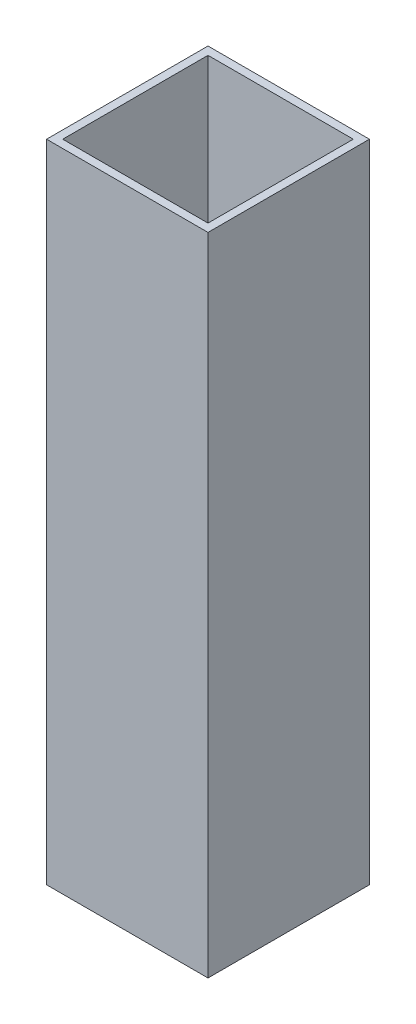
from build123d import *

# Parameters (mm, degrees)
SKETCH1_W           = 50
SKETCH1_H           = 50
BOSS_EXTRUDE1_DEPTH = 200
SHELL1_T            = -2.5


with BuildPart() as part:
    # Sketch1 → Boss-Extrude1 (new body)
    with BuildSketch(Plane(origin=(0, 0, 0), x_dir=(1, 0, 0), z_dir=(0, 1, 0))):
        Rectangle(SKETCH1_W, SKETCH1_H)
    extrude(amount=BOSS_EXTRUDE1_DEPTH)

    # Shell1
    shell1_openings = [part.faces().sort_by_distance(p)[0] for p in [
        (0, 200, 0),
        (0, 0, 0),
    ]]
    offset(amount=SHELL1_T, openings=shell1_openings, kind=Kind.INTERSECTION)


solid = part.part
